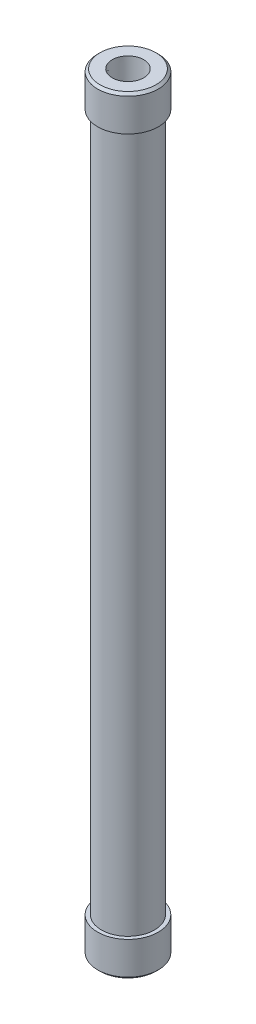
from build123d import *

# Parameters (mm, degrees)
SKETCH1_R           = 16.7005
SKETCH1_R_2         = 13.1445
BOSS_EXTRUDE1_DEPTH = 482.6
SKETCH2_R           = 19.05
BOSS_EXTRUDE2_DEPTH = 22.098
BOSS_EXTRUDE3_START = -22.098
SKETCH3_R           = 19.05
BOSS_EXTRUDE3_DEPTH = 22.098
CHAMFER2_SIZE       = 1.524


with BuildPart() as part:
    # Sketch1 → Boss-Extrude1 (new body)
    with BuildSketch(Plane(origin=(0, 0, 0), x_dir=(1, 0, 0), z_dir=(0, 1, 0))):
        with Locations(Location((0, 0, 0), (0, 0, 90))):
            Circle(SKETCH1_R)
        with Locations(Location((0, 0, 0), (0, 0, 90))):
            Circle(SKETCH1_R_2, mode=Mode.SUBTRACT)
    extrude(amount=BOSS_EXTRUDE1_DEPTH)

    # Sketch2 → Boss-Extrude2 (add)
    with BuildSketch(Plane(origin=(0, 0, 0), x_dir=(1, 0, 0), z_dir=(0, 1, 0))):
        with Locations(Location((0, 0, 0), (0, 0, 270))):
            Circle(SKETCH2_R)
    extrude(amount=BOSS_EXTRUDE2_DEPTH)

    # Sketch3 → Boss-Extrude3 (add)
    with BuildSketch(Plane(origin=(0, 482.6, 0), x_dir=(1, 0, 0), z_dir=(0, 1, 0)).offset(BOSS_EXTRUDE3_START)):
        with Locations(Location((0, 0, 0), (0, 0, 270))):
            Circle(SKETCH3_R)
    extrude(amount=BOSS_EXTRUDE3_DEPTH)

    # Sketch5 → 1_2 Rc Tapped Hole1 (revolve, cut)
    with BuildSketch(Plane(origin=(0, 0, 0), x_dir=(0, 0, -1), z_dir=(1, 0, 0))):
        Polygon((0, 0), (0, 29.387530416), (8.75, 24.13), (8.75, 14.986), (9.428250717, 14.986), (9.896063, 0), align=None)
    revolve(axis=Axis((0, -6.35, 0), (0, 1, 0)), mode=Mode.SUBTRACT)

    # Sketch7 → 1_2 Rc Tapped Hole2 (revolve, cut)
    with BuildSketch(Plane(origin=(0, 482.6, 0), x_dir=(0, 0, 1), z_dir=(1, 0, 0))):
        Polygon((0, 0), (0, 29.387530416), (8.75, 24.13), (8.75, 14.986), (9.428250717, 14.986), (9.896063, 0), align=None)
    revolve(axis=Axis((0, 488.95, 0), (0, -1, 0)), mode=Mode.SUBTRACT)

    # Chamfer2
    chamfer2_edges = [part.edges().sort_by_distance(p)[0] for p in [
        (0, 0, -19.05),
        (0, 482.6, -19.05),
    ]]
    chamfer(chamfer2_edges, length=CHAMFER2_SIZE)


solid = part.part
